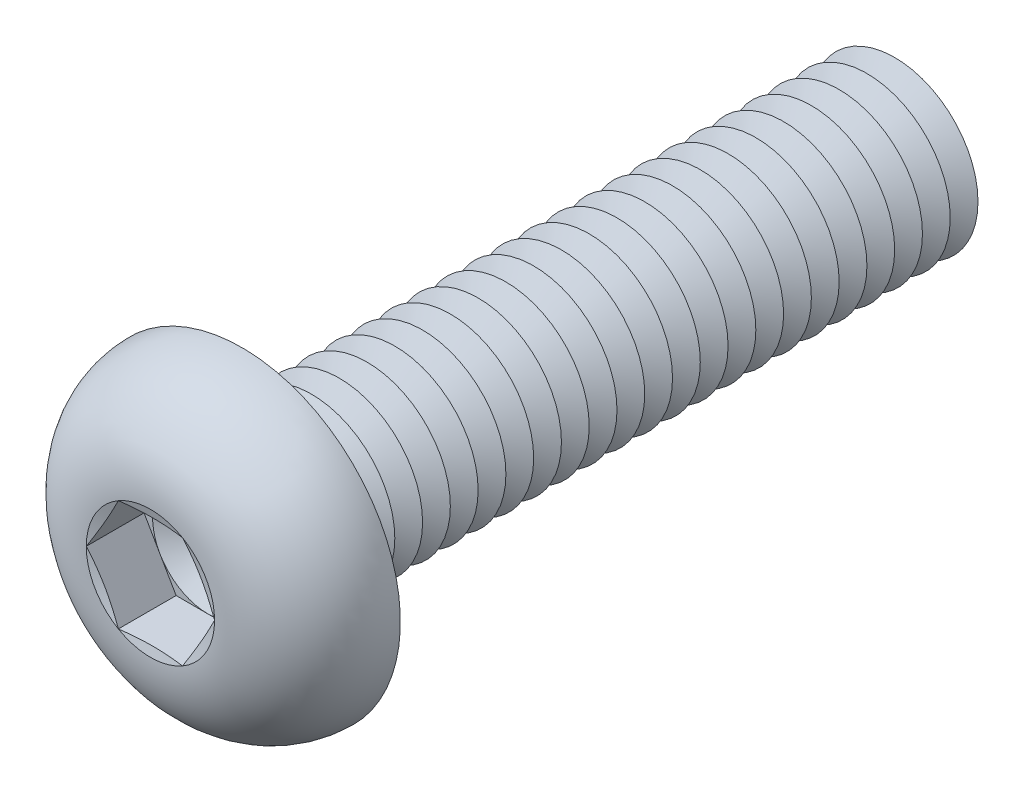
from build123d import *

# Parameters (mm, degrees)
FILLET1_R          = 0.25
LPATTERN1_COUNT    = 24
LPATTERN1_PITCH    = 0.5
CUT_EXTRUDE1_DEPTH = 1.04


with BuildPart() as part:
    # Sketch1 → Revolve1 (revolve)
    with BuildSketch(Plane(origin=(0, 0, 0), x_dir=(0, 0, -1), z_dir=(1, 0, 0)), mode=Mode.PRIVATE) as revolve1_sk:
        with BuildLine():
            Line((0, 1.5), (0, 2.85))
            ThreePointArc((0, 2.85), (-1.182850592, 2.35063849), (-1.65, 1.1547))
            Line((-1.65, 1.1547), (-1.495299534, 0.57735))
            Line((-1.495299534, 0.57735), (-1.65, 0.57735))
            Line((-1.65, 0.57735), (-1.65, 0))
            Line((-1.65, 0), (12, 0))
            Line((12, 0), (12, 1.5))
            Line((12, 1.5), (0, 1.5))
        make_face()
    revolve(revolve1_sk.sketch.rotate(Axis((0, 0, -12), (0, 0, 1)), 90), axis=Axis((0, 0, -12), (0, 0, 1)))

    # Fillet1
    fillet1_edges = [part.edges().sort_by_distance(p)[0] for p in [
        (1.5, 0, 0),
    ]]
    fillet(fillet1_edges, radius=FILLET1_R)

    # Sketch2 → Cut-Revolve1 (revolve, cut)
    with BuildSketch(Plane(origin=(0, 0, 0), x_dir=(0, 0, -1), z_dir=(1, 0, 0)), mode=Mode.PRIVATE) as cut_revolve1_sk:
        Polygon((11.75, 1.5), (12.25, 1.5), (12, 1.066987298), align=None)
    cut_revolve1 = revolve(cut_revolve1_sk.sketch.rotate(Axis((0, 0, -12), (0, 0, -1)), 270), axis=Axis((0, 0, -12), (0, 0, -1)), mode=Mode.SUBTRACT)

    # LPattern1: Cut-Revolve1 ×24
    with Locations(*[(0, 0, i * LPATTERN1_PITCH) for i in range(1, LPATTERN1_COUNT)]):
        add(cut_revolve1, mode=Mode.SUBTRACT)

    # Sketch3 → Cut-Extrude1 (cut)
    with BuildSketch(Plane.XY.offset(1.65)):
        Polygon((0.57735, 0.999999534), (-0.57735, 0.999999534), (-1.1547, 0), (-0.57735, -0.999999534), (0.57735, -0.999999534), (1.1547, 0), align=None)
    extrude(amount=-CUT_EXTRUDE1_DEPTH, mode=Mode.SUBTRACT)

    # Cut-Extrude2 cone 1 section (on through the dimple's axis) → Cut-Extrude2 (revolve, cut)
    with BuildSketch(Plane(origin=(0, 0, 0.61), x_dir=(0, -1, 0), z_dir=(1, 0, 0))):
        Polygon((0, 0), (0.999999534, 0), (0, 0.57735), align=None)
    revolve(axis=Axis((0, 0, 0.61), (0, 0, -1)), mode=Mode.SUBTRACT)


solid = part.part
